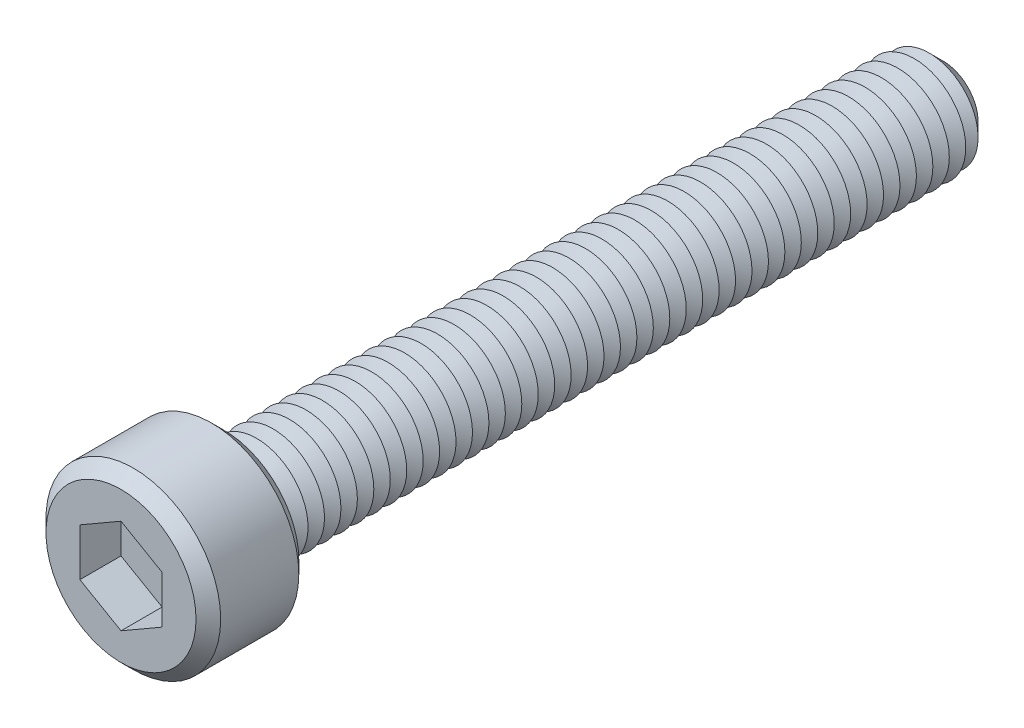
from build123d import *

# Parameters (mm, degrees)
SKETCH1_R           = 4.25
BOSS_EXTRUDE1_DEPTH = 5
SKETCH2_R           = 2.5
BOSS_EXTRUDE2_DEPTH = 35
CHAMFER1_SIZE       = 0.8
LPATTERN1_COUNT     = 43
LPATTERN1_PITCH     = 0.8
CUT_EXTRUDE1_DEPTH  = 2
SKETCH6_R           = 0.65
CUT_EXTRUDE2_DEPTH  = 38
CHAMFER2_SIZE       = 0.6


with BuildPart() as part:
    # Sketch1 → Boss-Extrude1 (new body)
    with BuildSketch(Plane.XY):
        Circle(SKETCH1_R)
    extrude(amount=BOSS_EXTRUDE1_DEPTH)

    # Sketch2 → Boss-Extrude2 (add)
    with BuildSketch(Plane(origin=(0, 0, 0), x_dir=(-1, 0, 0), z_dir=(0, 0, -1))):
        Circle(SKETCH2_R)
    extrude(amount=BOSS_EXTRUDE2_DEPTH)

    # Chamfer1
    chamfer1_edges = [part.edges().sort_by_distance(p)[0] for p in [
        (2.5, 0, -35),
    ]]
    chamfer(chamfer1_edges, length=CHAMFER1_SIZE)

    # Sketch4 → Cut-Revolve1 (revolve, cut)
    with BuildSketch(Plane(origin=(0, 0, 0), x_dir=(0, 0, -1), z_dir=(1, 0, 0)), mode=Mode.PRIVATE) as cut_revolve1_sk:
        Polygon((0, 2.5), (0.4, 1.807179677), (0.8, 2.5), align=None)
    cut_revolve1 = revolve(cut_revolve1_sk.sketch.rotate(Axis((0, 0, 2.512122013), (0, 0, -1)), 90), axis=Axis((0, 0, 2.512122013), (0, 0, -1)), mode=Mode.SUBTRACT)

    # LPattern1: Cut-Revolve1 ×43
    with Locations(*[(0, 0, -i * LPATTERN1_PITCH) for i in range(1, LPATTERN1_COUNT)]):
        add(cut_revolve1, mode=Mode.SUBTRACT)

    # Sketch5 → Cut-Extrude1 (cut)
    with BuildSketch(Plane.XY.offset(5)):
        Polygon((0, 2.309401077), (-2, 1.154700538), (-2, -1.154700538), (0, -2.309401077), (2, -1.154700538), (2, 1.154700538), align=None)
    extrude(amount=-CUT_EXTRUDE1_DEPTH, mode=Mode.SUBTRACT)

    # Sketch6 → Cut-Extrude2 (cut)
    with BuildSketch(Plane.XY.offset(3)):
        Circle(SKETCH6_R)
    extrude(amount=-CUT_EXTRUDE2_DEPTH, mode=Mode.SUBTRACT)

    # Chamfer2
    chamfer2_edges = [part.edges().sort_by_distance(p)[0] for p in [
        (-4.25, 0, 0),
        (-4.25, 0, 5),
    ]]
    chamfer(chamfer2_edges, length=CHAMFER2_SIZE)


solid = part.part
